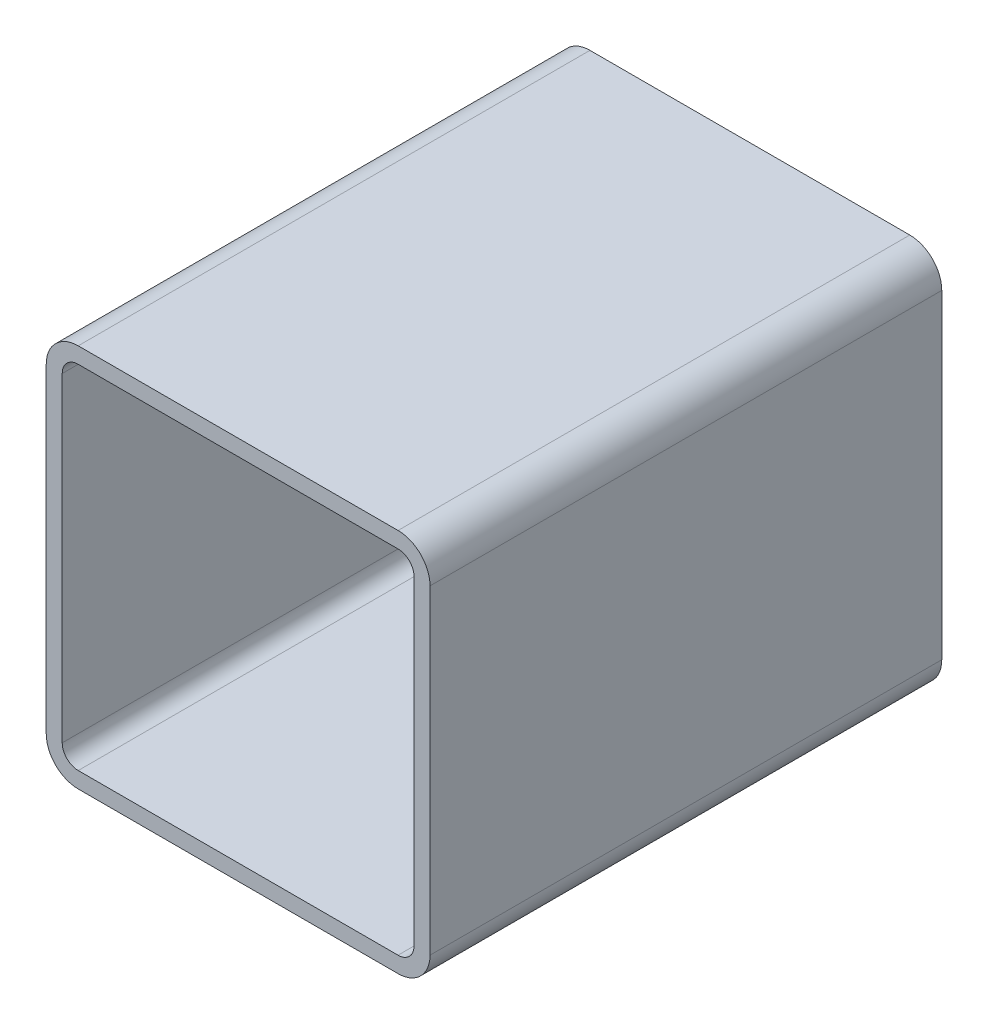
ISO-10303-21;
HEADER;
FILE_DESCRIPTION(('STEP AP214'),'2;1');
FILE_NAME('part.step','',(''),(''),'','','');
FILE_SCHEMA(('AUTOMOTIVE_DESIGN { 1 0 10303 214 1 1 1 1 }'));
ENDSEC;
DATA;
#1=APPLICATION_CONTEXT('core data for automotive mechanical design processes');
#2=APPLICATION_PROTOCOL_DEFINITION('international standard','automotive_design',2000,#1);
#3=PRODUCT_CONTEXT('',#1,'mechanical');
#4=PRODUCT('Part','Part','',(#3));
#5=PRODUCT_RELATED_PRODUCT_CATEGORY('part','',(#4));
#6=PRODUCT_DEFINITION_FORMATION('','',#4);
#7=PRODUCT_DEFINITION_CONTEXT('part definition',#1,'design');
#8=PRODUCT_DEFINITION('design','',#6,#7);
#9=PRODUCT_DEFINITION_SHAPE('','',#8);
#10=(LENGTH_UNIT() NAMED_UNIT(*) SI_UNIT(.MILLI.,.METRE.));
#11=(NAMED_UNIT(*) PLANE_ANGLE_UNIT() SI_UNIT($,.RADIAN.));
#12=(NAMED_UNIT(*) SI_UNIT($,.STERADIAN.) SOLID_ANGLE_UNIT());
#13=UNCERTAINTY_MEASURE_WITH_UNIT(LENGTH_MEASURE(1.E-05),#10,'distance_accuracy_value','');
#14=(GEOMETRIC_REPRESENTATION_CONTEXT(3) GLOBAL_UNCERTAINTY_ASSIGNED_CONTEXT((#13)) GLOBAL_UNIT_ASSIGNED_CONTEXT((#10,
#11,#12)) REPRESENTATION_CONTEXT('',''));
#15=CARTESIAN_POINT('',(0.,0.,0.));
#16=DIRECTION('',(0.,0.,1.));
#17=DIRECTION('',(1.,0.,0.));
#18=AXIS2_PLACEMENT_3D('',#15,#16,#17);
#19=CARTESIAN_POINT('',(19.6270021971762,211.493222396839,304.8));
#20=DIRECTION('',(0.,0.,1.));
#21=DIRECTION('',(1.,0.,0.));
#22=AXIS2_PLACEMENT_3D('',#19,#20,#21);
#23=PLANE('',#22);
#24=CARTESIAN_POINT('',(19.6270021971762,211.493222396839,304.8));
#25=DIRECTION('',(0.,0.,1.));
#26=DIRECTION('',(1.,0.,0.));
#27=AXIS2_PLACEMENT_3D('',#24,#25,#26);
#28=CIRCLE('',#27,19.05);
#29=CARTESIAN_POINT('',(19.6270021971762,230.543222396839,304.8));
#30=VERTEX_POINT('',#29);
#31=CARTESIAN_POINT('',(0.577002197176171,211.493222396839,304.8));
#32=VERTEX_POINT('',#31);
#33=EDGE_CURVE('E211',#30,#32,#28,.T.);
#34=ORIENTED_EDGE('',*,*,#33,.T.);
#35=DIRECTION('',(0.,-1.,0.));
#36=VECTOR('',#35,1.);
#37=CARTESIAN_POINT('',(0.577002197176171,20.9932223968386,304.8));
#38=LINE('',#37,#36);
#39=CARTESIAN_POINT('',(0.577002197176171,20.9932223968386,304.8));
#40=VERTEX_POINT('',#39);
#41=EDGE_CURVE('E214',#32,#40,#38,.T.);
#42=ORIENTED_EDGE('',*,*,#41,.T.);
#43=CARTESIAN_POINT('',(19.6270021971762,20.9932223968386,304.8));
#44=DIRECTION('',(0.,0.,1.));
#45=DIRECTION('',(1.,0.,0.));
#46=AXIS2_PLACEMENT_3D('',#43,#44,#45);
#47=CIRCLE('',#46,19.05);
#48=CARTESIAN_POINT('',(19.6270021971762,1.94322239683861,304.8));
#49=VERTEX_POINT('',#48);
#50=EDGE_CURVE('E217',#40,#49,#47,.T.);
#51=ORIENTED_EDGE('',*,*,#50,.T.);
#52=DIRECTION('',(1.,0.,0.));
#53=VECTOR('',#52,1.);
#54=CARTESIAN_POINT('',(210.127002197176,1.94322239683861,304.8));
#55=LINE('',#54,#53);
#56=CARTESIAN_POINT('',(210.127002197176,1.94322239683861,304.8));
#57=VERTEX_POINT('',#56);
#58=EDGE_CURVE('E219',#49,#57,#55,.T.);
#59=ORIENTED_EDGE('',*,*,#58,.T.);
#60=CARTESIAN_POINT('',(210.127002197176,20.9932223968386,304.8));
#61=DIRECTION('',(0.,0.,1.));
#62=DIRECTION('',(1.,0.,0.));
#63=AXIS2_PLACEMENT_3D('',#60,#61,#62);
#64=CIRCLE('',#63,19.05);
#65=CARTESIAN_POINT('',(229.177002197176,20.9932223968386,304.8));
#66=VERTEX_POINT('',#65);
#67=EDGE_CURVE('E221',#57,#66,#64,.T.);
#68=ORIENTED_EDGE('',*,*,#67,.T.);
#69=DIRECTION('',(0.,1.,0.));
#70=VECTOR('',#69,1.);
#71=CARTESIAN_POINT('',(229.177002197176,211.493222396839,304.8));
#72=LINE('',#71,#70);
#73=CARTESIAN_POINT('',(229.177002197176,211.493222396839,304.8));
#74=VERTEX_POINT('',#73);
#75=EDGE_CURVE('E223',#66,#74,#72,.T.);
#76=ORIENTED_EDGE('',*,*,#75,.T.);
#77=CARTESIAN_POINT('',(210.127002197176,211.493222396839,304.8));
#78=DIRECTION('',(0.,0.,1.));
#79=DIRECTION('',(1.,0.,0.));
#80=AXIS2_PLACEMENT_3D('',#77,#78,#79);
#81=CIRCLE('',#80,19.05);
#82=CARTESIAN_POINT('',(210.127002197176,230.543222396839,304.8));
#83=VERTEX_POINT('',#82);
#84=EDGE_CURVE('E225',#74,#83,#81,.T.);
#85=ORIENTED_EDGE('',*,*,#84,.T.);
#86=DIRECTION('',(-1.,0.,0.));
#87=VECTOR('',#86,1.);
#88=CARTESIAN_POINT('',(19.6270021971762,230.543222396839,304.8));
#89=LINE('',#88,#87);
#90=EDGE_CURVE('E227',#83,#30,#89,.T.);
#91=ORIENTED_EDGE('',*,*,#90,.T.);
#92=EDGE_LOOP('',(#34,#42,#51,#59,#68,#76,#85,#91));
#93=FACE_BOUND('',#92,.T.);
#94=DIRECTION('',(0.,-1.,0.));
#95=VECTOR('',#94,1.);
#96=CARTESIAN_POINT('',(10.1020021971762,20.9932223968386,304.8));
#97=LINE('',#96,#95);
#98=CARTESIAN_POINT('',(10.1020021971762,211.493222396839,304.8));
#99=VERTEX_POINT('',#98);
#100=CARTESIAN_POINT('',(10.1020021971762,20.9932223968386,304.8));
#101=VERTEX_POINT('',#100);
#102=EDGE_CURVE('E154',#99,#101,#97,.T.);
#103=ORIENTED_EDGE('',*,*,#102,.F.);
#104=CARTESIAN_POINT('',(19.6270021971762,211.493222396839,304.8));
#105=DIRECTION('',(0.,0.,1.));
#106=DIRECTION('',(1.,0.,0.));
#107=AXIS2_PLACEMENT_3D('',#104,#105,#106);
#108=CIRCLE('',#107,9.525);
#109=CARTESIAN_POINT('',(19.6270021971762,221.018222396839,304.8));
#110=VERTEX_POINT('',#109);
#111=EDGE_CURVE('E146',#110,#99,#108,.T.);
#112=ORIENTED_EDGE('',*,*,#111,.F.);
#113=DIRECTION('',(-1.,0.,0.));
#114=VECTOR('',#113,1.);
#115=CARTESIAN_POINT('',(19.6270021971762,221.018222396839,304.8));
#116=LINE('',#115,#114);
#117=CARTESIAN_POINT('',(210.127002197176,221.018222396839,304.8));
#118=VERTEX_POINT('',#117);
#119=EDGE_CURVE('E179',#118,#110,#116,.T.);
#120=ORIENTED_EDGE('',*,*,#119,.F.);
#121=CARTESIAN_POINT('',(210.127002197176,211.493222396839,304.8));
#122=DIRECTION('',(0.,0.,1.));
#123=DIRECTION('',(1.,0.,0.));
#124=AXIS2_PLACEMENT_3D('',#121,#122,#123);
#125=CIRCLE('',#124,9.52500000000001);
#126=CARTESIAN_POINT('',(219.652002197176,211.493222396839,304.8));
#127=VERTEX_POINT('',#126);
#128=EDGE_CURVE('E177',#127,#118,#125,.T.);
#129=ORIENTED_EDGE('',*,*,#128,.F.);
#130=DIRECTION('',(0.,1.,0.));
#131=VECTOR('',#130,1.);
#132=CARTESIAN_POINT('',(219.652002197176,211.493222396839,304.8));
#133=LINE('',#132,#131);
#134=CARTESIAN_POINT('',(219.652002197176,20.9932223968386,304.8));
#135=VERTEX_POINT('',#134);
#136=EDGE_CURVE('E175',#135,#127,#133,.T.);
#137=ORIENTED_EDGE('',*,*,#136,.F.);
#138=CARTESIAN_POINT('',(210.127002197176,20.9932223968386,304.8));
#139=DIRECTION('',(0.,0.,1.));
#140=DIRECTION('',(1.,0.,0.));
#141=AXIS2_PLACEMENT_3D('',#138,#139,#140);
#142=CIRCLE('',#141,9.52500000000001);
#143=CARTESIAN_POINT('',(210.127002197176,11.4682223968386,304.8));
#144=VERTEX_POINT('',#143);
#145=EDGE_CURVE('E173',#144,#135,#142,.T.);
#146=ORIENTED_EDGE('',*,*,#145,.F.);
#147=DIRECTION('',(1.,0.,0.));
#148=VECTOR('',#147,1.);
#149=CARTESIAN_POINT('',(210.127002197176,11.4682223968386,304.8));
#150=LINE('',#149,#148);
#151=CARTESIAN_POINT('',(19.6270021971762,11.4682223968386,304.8));
#152=VERTEX_POINT('',#151);
#153=EDGE_CURVE('E169',#152,#144,#150,.T.);
#154=ORIENTED_EDGE('',*,*,#153,.F.);
#155=CARTESIAN_POINT('',(19.6270021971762,20.9932223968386,304.8));
#156=DIRECTION('',(0.,0.,1.));
#157=DIRECTION('',(1.,0.,0.));
#158=AXIS2_PLACEMENT_3D('',#155,#156,#157);
#159=CIRCLE('',#158,9.525);
#160=EDGE_CURVE('E167',#101,#152,#159,.T.);
#161=ORIENTED_EDGE('',*,*,#160,.F.);
#162=EDGE_LOOP('',(#103,#112,#120,#129,#137,#146,#154,#161));
#163=FACE_BOUND('',#162,.T.);
#164=ADVANCED_FACE('F33',(#93,#163),#23,.T.);
#165=CARTESIAN_POINT('',(19.6270021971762,211.493222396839,0.));
#166=DIRECTION('',(0.,0.,1.));
#167=DIRECTION('',(1.,0.,0.));
#168=AXIS2_PLACEMENT_3D('',#165,#166,#167);
#169=PLANE('',#168);
#170=CARTESIAN_POINT('',(19.6270021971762,211.493222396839,0.));
#171=DIRECTION('',(0.,0.,1.));
#172=DIRECTION('',(1.,0.,0.));
#173=AXIS2_PLACEMENT_3D('',#170,#171,#172);
#174=CIRCLE('',#173,19.05);
#175=CARTESIAN_POINT('',(19.6270021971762,230.543222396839,0.));
#176=VERTEX_POINT('',#175);
#177=CARTESIAN_POINT('',(0.577002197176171,211.493222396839,0.));
#178=VERTEX_POINT('',#177);
#179=EDGE_CURVE('E162',#176,#178,#174,.T.);
#180=ORIENTED_EDGE('',*,*,#179,.F.);
#181=DIRECTION('',(-1.,0.,0.));
#182=VECTOR('',#181,1.);
#183=CARTESIAN_POINT('',(19.6270021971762,230.543222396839,0.));
#184=LINE('',#183,#182);
#185=CARTESIAN_POINT('',(210.127002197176,230.543222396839,0.));
#186=VERTEX_POINT('',#185);
#187=EDGE_CURVE('E215',#186,#176,#184,.T.);
#188=ORIENTED_EDGE('',*,*,#187,.F.);
#189=CARTESIAN_POINT('',(210.127002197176,211.493222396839,0.));
#190=DIRECTION('',(0.,0.,1.));
#191=DIRECTION('',(1.,0.,0.));
#192=AXIS2_PLACEMENT_3D('',#189,#190,#191);
#193=CIRCLE('',#192,19.05);
#194=CARTESIAN_POINT('',(229.177002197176,211.493222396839,0.));
#195=VERTEX_POINT('',#194);
#196=EDGE_CURVE('E242',#195,#186,#193,.T.);
#197=ORIENTED_EDGE('',*,*,#196,.F.);
#198=DIRECTION('',(0.,1.,0.));
#199=VECTOR('',#198,1.);
#200=CARTESIAN_POINT('',(229.177002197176,211.493222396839,0.));
#201=LINE('',#200,#199);
#202=CARTESIAN_POINT('',(229.177002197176,20.9932223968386,0.));
#203=VERTEX_POINT('',#202);
#204=EDGE_CURVE('E240',#203,#195,#201,.T.);
#205=ORIENTED_EDGE('',*,*,#204,.F.);
#206=CARTESIAN_POINT('',(210.127002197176,20.9932223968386,0.));
#207=DIRECTION('',(0.,0.,1.));
#208=DIRECTION('',(1.,0.,0.));
#209=AXIS2_PLACEMENT_3D('',#206,#207,#208);
#210=CIRCLE('',#209,19.05);
#211=CARTESIAN_POINT('',(210.127002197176,1.94322239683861,0.));
#212=VERTEX_POINT('',#211);
#213=EDGE_CURVE('E238',#212,#203,#210,.T.);
#214=ORIENTED_EDGE('',*,*,#213,.F.);
#215=DIRECTION('',(1.,0.,0.));
#216=VECTOR('',#215,1.);
#217=CARTESIAN_POINT('',(210.127002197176,1.94322239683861,0.));
#218=LINE('',#217,#216);
#219=CARTESIAN_POINT('',(19.6270021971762,1.94322239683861,0.));
#220=VERTEX_POINT('',#219);
#221=EDGE_CURVE('E236',#220,#212,#218,.T.);
#222=ORIENTED_EDGE('',*,*,#221,.F.);
#223=CARTESIAN_POINT('',(19.6270021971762,20.9932223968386,0.));
#224=DIRECTION('',(0.,0.,1.));
#225=DIRECTION('',(1.,0.,0.));
#226=AXIS2_PLACEMENT_3D('',#223,#224,#225);
#227=CIRCLE('',#226,19.05);
#228=CARTESIAN_POINT('',(0.577002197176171,20.9932223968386,0.));
#229=VERTEX_POINT('',#228);
#230=EDGE_CURVE('E234',#229,#220,#227,.T.);
#231=ORIENTED_EDGE('',*,*,#230,.F.);
#232=DIRECTION('',(0.,-1.,0.));
#233=VECTOR('',#232,1.);
#234=CARTESIAN_POINT('',(0.577002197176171,20.9932223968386,0.));
#235=LINE('',#234,#233);
#236=EDGE_CURVE('E232',#178,#229,#235,.T.);
#237=ORIENTED_EDGE('',*,*,#236,.F.);
#238=EDGE_LOOP('',(#180,#188,#197,#205,#214,#222,#231,#237));
#239=FACE_BOUND('',#238,.T.);
#240=CARTESIAN_POINT('',(19.6270021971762,211.493222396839,0.));
#241=DIRECTION('',(0.,0.,1.));
#242=DIRECTION('',(1.,0.,0.));
#243=AXIS2_PLACEMENT_3D('',#240,#241,#242);
#244=CIRCLE('',#243,9.525);
#245=CARTESIAN_POINT('',(19.6270021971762,221.018222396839,0.));
#246=VERTEX_POINT('',#245);
#247=CARTESIAN_POINT('',(10.1020021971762,211.493222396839,0.));
#248=VERTEX_POINT('',#247);
#249=EDGE_CURVE('E56',#246,#248,#244,.T.);
#250=ORIENTED_EDGE('',*,*,#249,.T.);
#251=DIRECTION('',(0.,-1.,0.));
#252=VECTOR('',#251,1.);
#253=CARTESIAN_POINT('',(10.1020021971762,20.9932223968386,0.));
#254=LINE('',#253,#252);
#255=CARTESIAN_POINT('',(10.1020021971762,20.9932223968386,0.));
#256=VERTEX_POINT('',#255);
#257=EDGE_CURVE('E161',#248,#256,#254,.T.);
#258=ORIENTED_EDGE('',*,*,#257,.T.);
#259=CARTESIAN_POINT('',(19.6270021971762,20.9932223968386,0.));
#260=DIRECTION('',(0.,0.,1.));
#261=DIRECTION('',(1.,0.,0.));
#262=AXIS2_PLACEMENT_3D('',#259,#260,#261);
#263=CIRCLE('',#262,9.525);
#264=CARTESIAN_POINT('',(19.6270021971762,11.4682223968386,0.));
#265=VERTEX_POINT('',#264);
#266=EDGE_CURVE('E183',#256,#265,#263,.T.);
#267=ORIENTED_EDGE('',*,*,#266,.T.);
#268=DIRECTION('',(1.,0.,0.));
#269=VECTOR('',#268,1.);
#270=CARTESIAN_POINT('',(210.127002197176,11.4682223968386,0.));
#271=LINE('',#270,#269);
#272=CARTESIAN_POINT('',(210.127002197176,11.4682223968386,0.));
#273=VERTEX_POINT('',#272);
#274=EDGE_CURVE('E186',#265,#273,#271,.T.);
#275=ORIENTED_EDGE('',*,*,#274,.T.);
#276=CARTESIAN_POINT('',(210.127002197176,20.9932223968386,0.));
#277=DIRECTION('',(0.,0.,1.));
#278=DIRECTION('',(1.,0.,0.));
#279=AXIS2_PLACEMENT_3D('',#276,#277,#278);
#280=CIRCLE('',#279,9.52500000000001);
#281=CARTESIAN_POINT('',(219.652002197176,20.9932223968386,0.));
#282=VERTEX_POINT('',#281);
#283=EDGE_CURVE('E189',#273,#282,#280,.T.);
#284=ORIENTED_EDGE('',*,*,#283,.T.);
#285=DIRECTION('',(0.,1.,0.));
#286=VECTOR('',#285,1.);
#287=CARTESIAN_POINT('',(219.652002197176,211.493222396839,0.));
#288=LINE('',#287,#286);
#289=CARTESIAN_POINT('',(219.652002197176,211.493222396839,0.));
#290=VERTEX_POINT('',#289);
#291=EDGE_CURVE('E192',#282,#290,#288,.T.);
#292=ORIENTED_EDGE('',*,*,#291,.T.);
#293=CARTESIAN_POINT('',(210.127002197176,211.493222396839,0.));
#294=DIRECTION('',(0.,0.,1.));
#295=DIRECTION('',(1.,0.,0.));
#296=AXIS2_PLACEMENT_3D('',#293,#294,#295);
#297=CIRCLE('',#296,9.52500000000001);
#298=CARTESIAN_POINT('',(210.127002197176,221.018222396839,0.));
#299=VERTEX_POINT('',#298);
#300=EDGE_CURVE('E195',#290,#299,#297,.T.);
#301=ORIENTED_EDGE('',*,*,#300,.T.);
#302=DIRECTION('',(-1.,0.,0.));
#303=VECTOR('',#302,1.);
#304=CARTESIAN_POINT('',(19.6270021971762,221.018222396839,0.));
#305=LINE('',#304,#303);
#306=EDGE_CURVE('E155',#299,#246,#305,.T.);
#307=ORIENTED_EDGE('',*,*,#306,.T.);
#308=EDGE_LOOP('',(#250,#258,#267,#275,#284,#292,#301,#307));
#309=FACE_BOUND('',#308,.T.);
#310=ADVANCED_FACE('F272',(#239,#309),#169,.F.);
#311=CARTESIAN_POINT('',(19.6270021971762,211.493222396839,304.8));
#312=DIRECTION('',(0.,0.,-1.));
#313=DIRECTION('',(-1.,0.,0.));
#314=AXIS2_PLACEMENT_3D('',#311,#312,#313);
#315=CYLINDRICAL_SURFACE('',#314,19.05);
#316=ORIENTED_EDGE('',*,*,#179,.T.);
#317=DIRECTION('',(0.,0.,-1.));
#318=VECTOR('',#317,1.);
#319=CARTESIAN_POINT('',(0.577002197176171,211.493222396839,304.8));
#320=LINE('',#319,#318);
#321=EDGE_CURVE('E11',#32,#178,#320,.T.);
#322=ORIENTED_EDGE('',*,*,#321,.F.);
#323=ORIENTED_EDGE('',*,*,#33,.F.);
#324=DIRECTION('',(0.,0.,-1.));
#325=VECTOR('',#324,1.);
#326=CARTESIAN_POINT('',(19.6270021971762,230.543222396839,304.8));
#327=LINE('',#326,#325);
#328=EDGE_CURVE('E229',#30,#176,#327,.T.);
#329=ORIENTED_EDGE('',*,*,#328,.T.);
#330=EDGE_LOOP('',(#316,#322,#323,#329));
#331=FACE_BOUND('',#330,.T.);
#332=ADVANCED_FACE('F35',(#331),#315,.T.);
#333=CARTESIAN_POINT('',(0.577002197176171,20.9932223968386,304.8));
#334=DIRECTION('',(1.,0.,0.));
#335=DIRECTION('',(0.,0.,-1.));
#336=AXIS2_PLACEMENT_3D('',#333,#334,#335);
#337=PLANE('',#336);
#338=ORIENTED_EDGE('',*,*,#236,.T.);
#339=DIRECTION('',(0.,0.,-1.));
#340=VECTOR('',#339,1.);
#341=CARTESIAN_POINT('',(0.577002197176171,20.9932223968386,304.8));
#342=LINE('',#341,#340);
#343=EDGE_CURVE('E41',#40,#229,#342,.T.);
#344=ORIENTED_EDGE('',*,*,#343,.F.);
#345=ORIENTED_EDGE('',*,*,#41,.F.);
#346=ORIENTED_EDGE('',*,*,#321,.T.);
#347=EDGE_LOOP('',(#338,#344,#345,#346));
#348=FACE_BOUND('',#347,.T.);
#349=ADVANCED_FACE('F289',(#348),#337,.F.);
#350=CARTESIAN_POINT('',(19.6270021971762,20.9932223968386,304.8));
#351=DIRECTION('',(0.,0.,-1.));
#352=DIRECTION('',(-1.,0.,0.));
#353=AXIS2_PLACEMENT_3D('',#350,#351,#352);
#354=CYLINDRICAL_SURFACE('',#353,19.05);
#355=ORIENTED_EDGE('',*,*,#230,.T.);
#356=DIRECTION('',(0.,0.,-1.));
#357=VECTOR('',#356,1.);
#358=CARTESIAN_POINT('',(19.6270021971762,1.94322239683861,304.8));
#359=LINE('',#358,#357);
#360=EDGE_CURVE('E259',#49,#220,#359,.T.);
#361=ORIENTED_EDGE('',*,*,#360,.F.);
#362=ORIENTED_EDGE('',*,*,#50,.F.);
#363=ORIENTED_EDGE('',*,*,#343,.T.);
#364=EDGE_LOOP('',(#355,#361,#362,#363));
#365=FACE_BOUND('',#364,.T.);
#366=ADVANCED_FACE('F266',(#365),#354,.T.);
#367=CARTESIAN_POINT('',(210.127002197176,1.94322239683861,304.8));
#368=DIRECTION('',(0.,1.,0.));
#369=DIRECTION('',(0.,0.,1.));
#370=AXIS2_PLACEMENT_3D('',#367,#368,#369);
#371=PLANE('',#370);
#372=ORIENTED_EDGE('',*,*,#221,.T.);
#373=DIRECTION('',(0.,0.,-1.));
#374=VECTOR('',#373,1.);
#375=CARTESIAN_POINT('',(210.127002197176,1.94322239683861,304.8));
#376=LINE('',#375,#374);
#377=EDGE_CURVE('E256',#57,#212,#376,.T.);
#378=ORIENTED_EDGE('',*,*,#377,.F.);
#379=ORIENTED_EDGE('',*,*,#58,.F.);
#380=ORIENTED_EDGE('',*,*,#360,.T.);
#381=EDGE_LOOP('',(#372,#378,#379,#380));
#382=FACE_BOUND('',#381,.T.);
#383=ADVANCED_FACE('F278',(#382),#371,.F.);
#384=CARTESIAN_POINT('',(210.127002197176,20.9932223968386,304.8));
#385=DIRECTION('',(0.,0.,-1.));
#386=DIRECTION('',(-1.,0.,0.));
#387=AXIS2_PLACEMENT_3D('',#384,#385,#386);
#388=CYLINDRICAL_SURFACE('',#387,19.05);
#389=ORIENTED_EDGE('',*,*,#213,.T.);
#390=DIRECTION('',(0.,0.,-1.));
#391=VECTOR('',#390,1.);
#392=CARTESIAN_POINT('',(229.177002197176,20.9932223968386,304.8));
#393=LINE('',#392,#391);
#394=EDGE_CURVE('E253',#66,#203,#393,.T.);
#395=ORIENTED_EDGE('',*,*,#394,.F.);
#396=ORIENTED_EDGE('',*,*,#67,.F.);
#397=ORIENTED_EDGE('',*,*,#377,.T.);
#398=EDGE_LOOP('',(#389,#395,#396,#397));
#399=FACE_BOUND('',#398,.T.);
#400=ADVANCED_FACE('F282',(#399),#388,.T.);
#401=CARTESIAN_POINT('',(229.177002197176,211.493222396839,304.8));
#402=DIRECTION('',(-1.,0.,0.));
#403=DIRECTION('',(0.,0.,1.));
#404=AXIS2_PLACEMENT_3D('',#401,#402,#403);
#405=PLANE('',#404);
#406=ORIENTED_EDGE('',*,*,#204,.T.);
#407=DIRECTION('',(0.,0.,-1.));
#408=VECTOR('',#407,1.);
#409=CARTESIAN_POINT('',(229.177002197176,211.493222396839,304.8));
#410=LINE('',#409,#408);
#411=EDGE_CURVE('E250',#74,#195,#410,.T.);
#412=ORIENTED_EDGE('',*,*,#411,.F.);
#413=ORIENTED_EDGE('',*,*,#75,.F.);
#414=ORIENTED_EDGE('',*,*,#394,.T.);
#415=EDGE_LOOP('',(#406,#412,#413,#414));
#416=FACE_BOUND('',#415,.T.);
#417=ADVANCED_FACE('F302',(#416),#405,.F.);
#418=CARTESIAN_POINT('',(210.127002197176,211.493222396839,304.8));
#419=DIRECTION('',(0.,0.,-1.));
#420=DIRECTION('',(-1.,0.,0.));
#421=AXIS2_PLACEMENT_3D('',#418,#419,#420);
#422=CYLINDRICAL_SURFACE('',#421,19.05);
#423=ORIENTED_EDGE('',*,*,#196,.T.);
#424=DIRECTION('',(0.,0.,-1.));
#425=VECTOR('',#424,1.);
#426=CARTESIAN_POINT('',(210.127002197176,230.543222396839,304.8));
#427=LINE('',#426,#425);
#428=EDGE_CURVE('E247',#83,#186,#427,.T.);
#429=ORIENTED_EDGE('',*,*,#428,.F.);
#430=ORIENTED_EDGE('',*,*,#84,.F.);
#431=ORIENTED_EDGE('',*,*,#411,.T.);
#432=EDGE_LOOP('',(#423,#429,#430,#431));
#433=FACE_BOUND('',#432,.T.);
#434=ADVANCED_FACE('F300',(#433),#422,.T.);
#435=CARTESIAN_POINT('',(19.6270021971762,230.543222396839,304.8));
#436=DIRECTION('',(0.,-1.,0.));
#437=DIRECTION('',(0.,0.,-1.));
#438=AXIS2_PLACEMENT_3D('',#435,#436,#437);
#439=PLANE('',#438);
#440=ORIENTED_EDGE('',*,*,#187,.T.);
#441=ORIENTED_EDGE('',*,*,#328,.F.);
#442=ORIENTED_EDGE('',*,*,#90,.F.);
#443=ORIENTED_EDGE('',*,*,#428,.T.);
#444=EDGE_LOOP('',(#440,#441,#442,#443));
#445=FACE_BOUND('',#444,.T.);
#446=ADVANCED_FACE('F295',(#445),#439,.F.);
#447=CARTESIAN_POINT('',(19.6270021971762,211.493222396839,304.8));
#448=DIRECTION('',(0.,0.,-1.));
#449=DIRECTION('',(-1.,0.,0.));
#450=AXIS2_PLACEMENT_3D('',#447,#448,#449);
#451=CYLINDRICAL_SURFACE('',#450,9.525);
#452=ORIENTED_EDGE('',*,*,#249,.F.);
#453=DIRECTION('',(0.,0.,-1.));
#454=VECTOR('',#453,1.);
#455=CARTESIAN_POINT('',(19.6270021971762,221.018222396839,304.8));
#456=LINE('',#455,#454);
#457=EDGE_CURVE('E150',#110,#246,#456,.T.);
#458=ORIENTED_EDGE('',*,*,#457,.F.);
#459=ORIENTED_EDGE('',*,*,#111,.T.);
#460=DIRECTION('',(0.,0.,-1.));
#461=VECTOR('',#460,1.);
#462=CARTESIAN_POINT('',(10.1020021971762,211.493222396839,304.8));
#463=LINE('',#462,#461);
#464=EDGE_CURVE('E149',#99,#248,#463,.T.);
#465=ORIENTED_EDGE('',*,*,#464,.T.);
#466=EDGE_LOOP('',(#452,#458,#459,#465));
#467=FACE_BOUND('',#466,.T.);
#468=ADVANCED_FACE('F148',(#467),#451,.F.);
#469=CARTESIAN_POINT('',(10.1020021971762,20.9932223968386,304.8));
#470=DIRECTION('',(1.,0.,0.));
#471=DIRECTION('',(0.,0.,-1.));
#472=AXIS2_PLACEMENT_3D('',#469,#470,#471);
#473=PLANE('',#472);
#474=ORIENTED_EDGE('',*,*,#257,.F.);
#475=ORIENTED_EDGE('',*,*,#464,.F.);
#476=ORIENTED_EDGE('',*,*,#102,.T.);
#477=DIRECTION('',(0.,0.,-1.));
#478=VECTOR('',#477,1.);
#479=CARTESIAN_POINT('',(10.1020021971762,20.9932223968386,304.8));
#480=LINE('',#479,#478);
#481=EDGE_CURVE('E163',#101,#256,#480,.T.);
#482=ORIENTED_EDGE('',*,*,#481,.T.);
#483=EDGE_LOOP('',(#474,#475,#476,#482));
#484=FACE_BOUND('',#483,.T.);
#485=ADVANCED_FACE('F158',(#484),#473,.T.);
#486=CARTESIAN_POINT('',(19.6270021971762,20.9932223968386,304.8));
#487=DIRECTION('',(0.,0.,-1.));
#488=DIRECTION('',(-1.,0.,0.));
#489=AXIS2_PLACEMENT_3D('',#486,#487,#488);
#490=CYLINDRICAL_SURFACE('',#489,9.525);
#491=ORIENTED_EDGE('',*,*,#266,.F.);
#492=ORIENTED_EDGE('',*,*,#481,.F.);
#493=ORIENTED_EDGE('',*,*,#160,.T.);
#494=DIRECTION('',(0.,0.,-1.));
#495=VECTOR('',#494,1.);
#496=CARTESIAN_POINT('',(19.6270021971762,11.4682223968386,304.8));
#497=LINE('',#496,#495);
#498=EDGE_CURVE('E208',#152,#265,#497,.T.);
#499=ORIENTED_EDGE('',*,*,#498,.T.);
#500=EDGE_LOOP('',(#491,#492,#493,#499));
#501=FACE_BOUND('',#500,.T.);
#502=ADVANCED_FACE('F327',(#501),#490,.F.);
#503=CARTESIAN_POINT('',(210.127002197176,11.4682223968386,304.8));
#504=DIRECTION('',(0.,1.,0.));
#505=DIRECTION('',(0.,0.,1.));
#506=AXIS2_PLACEMENT_3D('',#503,#504,#505);
#507=PLANE('',#506);
#508=ORIENTED_EDGE('',*,*,#274,.F.);
#509=ORIENTED_EDGE('',*,*,#498,.F.);
#510=ORIENTED_EDGE('',*,*,#153,.T.);
#511=DIRECTION('',(0.,0.,-1.));
#512=VECTOR('',#511,1.);
#513=CARTESIAN_POINT('',(210.127002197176,11.4682223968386,304.8));
#514=LINE('',#513,#512);
#515=EDGE_CURVE('E206',#144,#273,#514,.T.);
#516=ORIENTED_EDGE('',*,*,#515,.T.);
#517=EDGE_LOOP('',(#508,#509,#510,#516));
#518=FACE_BOUND('',#517,.T.);
#519=ADVANCED_FACE('F331',(#518),#507,.T.);
#520=CARTESIAN_POINT('',(210.127002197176,20.9932223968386,304.8));
#521=DIRECTION('',(0.,0.,-1.));
#522=DIRECTION('',(-1.,0.,0.));
#523=AXIS2_PLACEMENT_3D('',#520,#521,#522);
#524=CYLINDRICAL_SURFACE('',#523,9.52500000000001);
#525=ORIENTED_EDGE('',*,*,#283,.F.);
#526=ORIENTED_EDGE('',*,*,#515,.F.);
#527=ORIENTED_EDGE('',*,*,#145,.T.);
#528=DIRECTION('',(0.,0.,-1.));
#529=VECTOR('',#528,1.);
#530=CARTESIAN_POINT('',(219.652002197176,20.9932223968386,304.8));
#531=LINE('',#530,#529);
#532=EDGE_CURVE('E204',#135,#282,#531,.T.);
#533=ORIENTED_EDGE('',*,*,#532,.T.);
#534=EDGE_LOOP('',(#525,#526,#527,#533));
#535=FACE_BOUND('',#534,.T.);
#536=ADVANCED_FACE('F337',(#535),#524,.F.);
#537=CARTESIAN_POINT('',(219.652002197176,211.493222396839,304.8));
#538=DIRECTION('',(-1.,0.,0.));
#539=DIRECTION('',(0.,0.,1.));
#540=AXIS2_PLACEMENT_3D('',#537,#538,#539);
#541=PLANE('',#540);
#542=ORIENTED_EDGE('',*,*,#291,.F.);
#543=ORIENTED_EDGE('',*,*,#532,.F.);
#544=ORIENTED_EDGE('',*,*,#136,.T.);
#545=DIRECTION('',(0.,0.,-1.));
#546=VECTOR('',#545,1.);
#547=CARTESIAN_POINT('',(219.652002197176,211.493222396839,304.8));
#548=LINE('',#547,#546);
#549=EDGE_CURVE('E202',#127,#290,#548,.T.);
#550=ORIENTED_EDGE('',*,*,#549,.T.);
#551=EDGE_LOOP('',(#542,#543,#544,#550));
#552=FACE_BOUND('',#551,.T.);
#553=ADVANCED_FACE('F341',(#552),#541,.T.);
#554=CARTESIAN_POINT('',(210.127002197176,211.493222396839,304.8));
#555=DIRECTION('',(0.,0.,-1.));
#556=DIRECTION('',(-1.,0.,0.));
#557=AXIS2_PLACEMENT_3D('',#554,#555,#556);
#558=CYLINDRICAL_SURFACE('',#557,9.52500000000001);
#559=ORIENTED_EDGE('',*,*,#300,.F.);
#560=ORIENTED_EDGE('',*,*,#549,.F.);
#561=ORIENTED_EDGE('',*,*,#128,.T.);
#562=DIRECTION('',(0.,0.,-1.));
#563=VECTOR('',#562,1.);
#564=CARTESIAN_POINT('',(210.127002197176,221.018222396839,304.8));
#565=LINE('',#564,#563);
#566=EDGE_CURVE('E48',#118,#299,#565,.T.);
#567=ORIENTED_EDGE('',*,*,#566,.T.);
#568=EDGE_LOOP('',(#559,#560,#561,#567));
#569=FACE_BOUND('',#568,.T.);
#570=ADVANCED_FACE('F345',(#569),#558,.F.);
#571=CARTESIAN_POINT('',(19.6270021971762,221.018222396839,304.8));
#572=DIRECTION('',(0.,-1.,0.));
#573=DIRECTION('',(0.,0.,-1.));
#574=AXIS2_PLACEMENT_3D('',#571,#572,#573);
#575=PLANE('',#574);
#576=ORIENTED_EDGE('',*,*,#306,.F.);
#577=ORIENTED_EDGE('',*,*,#566,.F.);
#578=ORIENTED_EDGE('',*,*,#119,.T.);
#579=ORIENTED_EDGE('',*,*,#457,.T.);
#580=EDGE_LOOP('',(#576,#577,#578,#579));
#581=FACE_BOUND('',#580,.T.);
#582=ADVANCED_FACE('F349',(#581),#575,.T.);
#583=CLOSED_SHELL('',(#164,#310,#332,#349,#366,#383,#400,#417,#434,#446,#468,#485,#502,#519,
#536,#553,#570,#582));
#584=MANIFOLD_SOLID_BREP('B2',#583);
#585=ADVANCED_BREP_SHAPE_REPRESENTATION('',(#18,#584),#14);
#586=SHAPE_DEFINITION_REPRESENTATION(#9,#585);
ENDSEC;
END-ISO-10303-21;
